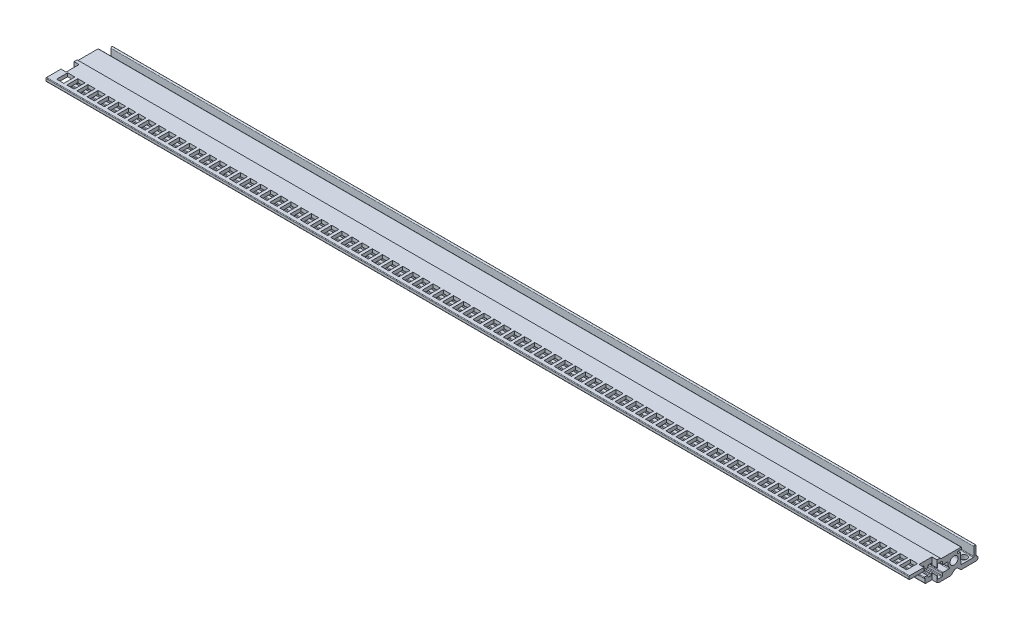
from build123d import *

# Parameters (mm, degrees)
SKETCH_1_R          = 2
EXTRUDE_1_DEPTH     = 215.9
EXTRUDE_4_DEPTH     = 431.8
EXTRUDE_3_DEPTH     = 431.8
CUT_EXTRUDE_1_REACH = 219.734
SKETCH_3_W          = 2.54
SKETCH_3_H          = 6.5
SKETCH_4_R          = 1.65
CUT_EXTRUDE_2_DEPTH = 9.8
SKETCH_5_W          = 3.6
SKETCH_5_H          = 5.5
CUT_EXTRUDE_3_DEPTH = 9.9
FILLET_1_R          = 0.3


with BuildPart() as part:
    # Sketch 1 → Extrude 1 (new, symmetric)
    with BuildSketch(Plane(origin=(0, 0, 0), x_dir=(0, 0, -1), z_dir=(1, 0, 0))):
        with BuildLine():
            Line((2.006061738, 2.145757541), (2.056061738, 2.145757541))
            ThreePointArc((2.056061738, 2.145757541), (2.197483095, 2.087178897), (2.256061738, 1.945757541))
            Line((2.256061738, 1.945757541), (2.256061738, -0.054242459))
            ThreePointArc((2.256061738, -0.054242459), (2.343929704, -0.266374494), (2.556061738, -0.354242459))
            Line((2.556061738, -0.354242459), (6.056061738, -0.354242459))
            ThreePointArc((6.056061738, -0.354242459), (6.245798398, -0.421863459), (6.350000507, -0.594242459))
            ThreePointArc((6.350000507, -0.594242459), (6.41946858, -0.709161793), (6.545959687, -0.754242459))
            Line((6.545959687, -0.754242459), (12.640079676, -0.754242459))
            ThreePointArc((12.640079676, -0.754242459), (12.748258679, -0.734059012), (12.841881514, -0.676224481))
            Line((12.841881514, -0.676224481), (14.682337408, 0.99691724))
            ThreePointArc((14.682337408, 0.99691724), (14.873755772, 1.07475547), (15.070100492, 1.010346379))
            ThreePointArc((15.070100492, 1.010346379), (15.256061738, 0.945757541), (15.442022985, 1.010346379))
            ThreePointArc((15.442022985, 1.010346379), (15.638367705, 1.07475547), (15.829786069, 0.99691724))
            Line((15.829786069, 0.99691724), (17.670241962, -0.676224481))
            ThreePointArc((17.670241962, -0.676224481), (17.763864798, -0.734059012), (17.872043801, -0.754242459))
            Line((17.872043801, -0.754242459), (25.156061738, -0.754242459))
            ThreePointArc((25.156061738, -0.754242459), (26.244537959, 0.186951), (25.470347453, 1.399903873))
            ThreePointArc((25.470347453, 1.399903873), (25.315526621, 1.508114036), (25.256061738, 1.687398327))
            Line((25.256061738, 1.687398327), (25.256061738, 6.045757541))
            ThreePointArc((25.256061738, 6.045757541), (24.756061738, 6.545757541), (24.256061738, 6.045757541))
            Line((24.256061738, 6.045757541), (24.256061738, 1.745757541))
            ThreePointArc((24.256061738, 1.745757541), (24.168193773, 1.533625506), (23.956061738, 1.445757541))
            Line((23.956061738, 1.445757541), (18.056061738, 1.445757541))
            ThreePointArc((18.056061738, 1.445757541), (17.843929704, 1.533625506), (17.756061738, 1.745757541))
            Line((17.756061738, 1.745757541), (17.756061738, 3.099347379))
            ThreePointArc((17.756061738, 3.099347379), (17.729266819, 3.199347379), (17.656061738, 3.27255246))
            ThreePointArc((17.656061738, 3.27255246), (17.582856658, 3.345757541), (17.556061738, 3.445757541))
            Line((17.556061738, 3.445757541), (17.556061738, 6.745757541))
            ThreePointArc((17.556061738, 6.745757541), (17.468193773, 6.957889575), (17.256061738, 7.045757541))
            Line((17.256061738, 7.045757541), (16.356061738, 7.045757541))
            ThreePointArc((16.356061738, 7.045757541), (16.143929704, 7.133625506), (16.056061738, 7.345757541))
            Line((16.056061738, 7.345757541), (16.056061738, 7.745757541))
            ThreePointArc((16.056061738, 7.745757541), (16.143929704, 7.957889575), (16.356061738, 8.045757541))
            Line((16.356061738, 8.045757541), (17.756061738, 8.045757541))
            ThreePointArc((17.756061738, 8.045757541), (17.968193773, 8.133625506), (18.056061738, 8.345757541))
            Line((18.056061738, 8.345757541), (18.056061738, 8.745757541))
            ThreePointArc((18.056061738, 8.745757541), (17.968193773, 8.957889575), (17.756061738, 9.045757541))
            Line((17.756061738, 9.045757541), (-7.943938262, 9.045757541))
            ThreePointArc((-7.943938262, 9.045757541), (-8.156070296, 8.957889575), (-8.243938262, 8.745757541))
            Line((-8.243938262, 8.745757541), (-8.243938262, 8.145757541))
            ThreePointArc((-8.243938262, 8.145757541), (-8.156070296, 7.933625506), (-7.943938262, 7.845757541))
            Line((-7.943938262, 7.845757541), (1.456061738, 7.845757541))
            ThreePointArc((1.456061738, 7.845757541), (1.668193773, 7.757889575), (1.756061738, 7.545757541))
            Line((1.756061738, 7.545757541), (1.756061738, 6.345757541))
            ThreePointArc((1.756061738, 6.345757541), (1.843929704, 6.133625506), (2.056061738, 6.045757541))
            Line((2.056061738, 6.045757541), (3.456061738, 6.045757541))
            ThreePointArc((3.456061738, 6.045757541), (3.668193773, 6.133625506), (3.756061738, 6.345757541))
            Line((3.756061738, 6.345757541), (3.756061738, 6.745757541))
            ThreePointArc((3.756061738, 6.745757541), (3.843929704, 6.957889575), (4.056061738, 7.045757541))
            Line((4.056061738, 7.045757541), (5.156061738, 7.045757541))
            ThreePointArc((5.156061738, 7.045757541), (5.368193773, 6.957889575), (5.456061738, 6.745757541))
            Line((5.456061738, 6.745757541), (5.456061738, 6.345757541))
            ThreePointArc((5.456061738, 6.345757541), (5.756061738, 6.045757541), (6.056061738, 6.345757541))
            Line((6.056061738, 6.345757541), (6.056061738, 7.405757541))
            ThreePointArc((6.056061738, 7.405757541), (6.143929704, 7.617889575), (6.356061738, 7.705757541))
            Line((6.356061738, 7.705757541), (8.156061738, 7.705757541))
            ThreePointArc((8.156061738, 7.705757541), (8.368193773, 7.617889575), (8.456061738, 7.405757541))
            Line((8.456061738, 7.405757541), (8.456061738, 6.345757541))
            ThreePointArc((8.456061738, 6.345757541), (8.543929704, 6.133625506), (8.756061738, 6.045757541))
            Line((8.756061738, 6.045757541), (10.980012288, 6.045757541))
            ThreePointArc((10.980012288, 6.045757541), (11.213256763, 5.934429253), (11.273389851, 5.683070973))
            ThreePointArc((11.273389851, 5.683070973), (11.28883719, 4.340010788), (11.879723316, 3.133817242))
            ThreePointArc((11.879723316, 3.133817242), (11.916556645, 2.816177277), (11.645985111, 2.645757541))
            Line((11.645985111, 2.645757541), (8.756061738, 2.645757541))
            ThreePointArc((8.756061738, 2.645757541), (8.543929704, 2.557889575), (8.456061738, 2.345757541))
            Line((8.456061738, 2.345757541), (8.456061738, 1.285757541))
            ThreePointArc((8.456061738, 1.285757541), (8.368193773, 1.073625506), (8.156061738, 0.985757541))
            Line((8.156061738, 0.985757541), (6.356061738, 0.985757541))
            ThreePointArc((6.356061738, 0.985757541), (6.143929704, 1.073625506), (6.056061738, 1.285757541))
            Line((6.056061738, 1.285757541), (6.056061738, 2.345757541))
            ThreePointArc((6.056061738, 2.345757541), (5.756061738, 2.645757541), (5.456061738, 2.345757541))
            Line((5.456061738, 2.345757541), (5.456061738, 1.945757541))
            ThreePointArc((5.456061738, 1.945757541), (5.368193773, 1.733625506), (5.156061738, 1.645757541))
            Line((5.156061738, 1.645757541), (4.056061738, 1.645757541))
            ThreePointArc((4.056061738, 1.645757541), (3.843929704, 1.733625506), (3.756061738, 1.945757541))
            Line((3.756061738, 1.945757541), (3.756061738, 2.345757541))
            ThreePointArc((3.756061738, 2.345757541), (3.668193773, 2.557889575), (3.456061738, 2.645757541))
            Line((3.456061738, 2.645757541), (2.006061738, 2.645757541))
            ThreePointArc((2.006061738, 2.645757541), (1.756061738, 2.395757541), (2.006061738, 2.145757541))
        make_face()
        with Locations((14.256061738, 5.045757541)):
            Circle(SKETCH_1_R, mode=Mode.SUBTRACT)
    extrude(amount=EXTRUDE_1_DEPTH, both=True)

    # Sketch 7 → Extrude 4 (add, through all)
    with BuildSketch(Plane(origin=(215.9, 0, 0), x_dir=(0, 0, -1), z_dir=(1, 0, 0))):
        with BuildLine():
            Line((-7.943938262, 9.045757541), (-8.243938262, 9.045757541))
            Line((-8.243938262, 9.045757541), (-8.243938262, 8.745757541))
            ThreePointArc((-8.243938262, 8.745757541), (-8.156070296, 8.957889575), (-7.943938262, 9.045757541))
        make_face()
    extrude(amount=-EXTRUDE_4_DEPTH)

    # Sketch 6 → Extrude 3 (add, through all)
    with BuildSketch(Plane.ZY.offset(215.9)):
        Polygon((-7.806061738, 9.045757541), (8.243938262, 9.045757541), (8.243938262, 9.545757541), (-7.306061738, 9.545757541), align=None)
    extrude(amount=-EXTRUDE_3_DEPTH)

    # Cut-Extrude 1: up to this face of the body (flat: up to its plane)
    cut_extrude_1_end = Plane(part.part.faces().sort_by_distance((0, -0.754242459, -9.593019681))[0])
    # Sketch 3 → Cut-Extrude 1 (cut, up to the picked face)
    with BuildSketch(Plane(origin=(0, 9.545757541, 0), x_dir=(1, 0, 0), z_dir=(0, 1, 0)), mode=Mode.PRIVATE) as cut_extrude_1_sk1:
        with Locations((214.63, 2.506061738)):
            Rectangle(SKETCH_3_W, SKETCH_3_H)
    cut_extrude_1_tool1 = split(extrude(cut_extrude_1_sk1.sketch, amount=-CUT_EXTRUDE_1_REACH, mode=Mode.PRIVATE), bisect_by=cut_extrude_1_end, keep=Keep.BOTH, mode=Mode.PRIVATE)
    # Sketch 3 → Cut-Extrude 1 (cut, up to the picked face)
    with BuildSketch(Plane(origin=(0, 9.545757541, 0), x_dir=(1, 0, 0), z_dir=(0, 1, 0)), mode=Mode.PRIVATE) as cut_extrude_1_sk2:
        with Locations((-214.63, 2.506061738)):
            Rectangle(SKETCH_3_W, SKETCH_3_H)
    cut_extrude_1_tool2 = split(extrude(cut_extrude_1_sk2.sketch, amount=-CUT_EXTRUDE_1_REACH, mode=Mode.PRIVATE), bisect_by=cut_extrude_1_end, keep=Keep.BOTH, mode=Mode.PRIVATE)
    add(cut_extrude_1_tool1.solids().sort_by(Axis((214.63, 9.545758, -2.506062), (0, -1, 0)))[0], mode=Mode.SUBTRACT)
    add(cut_extrude_1_tool2.solids().sort_by(Axis((-214.63, 9.545758, -2.506062), (0, -1, 0)))[0], mode=Mode.SUBTRACT)

    # Sketch 4 → Cut-Extrude 2 (cut)
    with BuildSketch(Plane(origin=(0, -0.754242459, 0), x_dir=(-1, 0, 0), z_dir=(0, -1, 0))):
        with Locations(Location((-213.36, 21.706061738, 0), (0, 0, 90))):
            Circle(SKETCH_4_R)
        with Locations(Location((-208.28, 21.706061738, 0), (0, 0, 90))):
            Circle(SKETCH_4_R)
        with Locations(Location((-203.2, 21.706061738, 0), (0, 0, 90))):
            Circle(SKETCH_4_R)
        with Locations(Location((-198.12, 21.706061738, 0), (0, 0, 90))):
            Circle(SKETCH_4_R)
        with Locations(Location((-193.04, 21.706061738, 0), (0, 0, 90))):
            Circle(SKETCH_4_R)
        with Locations(Location((-187.96, 21.706061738, 0), (0, 0, 90))):
            Circle(SKETCH_4_R)
        with Locations(Location((-182.88, 21.706061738, 0), (0, 0, 90))):
            Circle(SKETCH_4_R)
        with Locations(Location((-177.8, 21.706061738, 0), (0, 0, 90))):
            Circle(SKETCH_4_R)
        with Locations(Location((-172.72, 21.706061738, 0), (0, 0, 90))):
            Circle(SKETCH_4_R)
        with Locations(Location((-167.64, 21.706061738, 0), (0, 0, 90))):
            Circle(SKETCH_4_R)
        with Locations(Location((-162.56, 21.706061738, 0), (0, 0, 90))):
            Circle(SKETCH_4_R)
        with Locations(Location((-157.48, 21.706061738, 0), (0, 0, 90))):
            Circle(SKETCH_4_R)
        with Locations(Location((-152.4, 21.706061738, 0), (0, 0, 90))):
            Circle(SKETCH_4_R)
        with Locations(Location((-147.32, 21.706061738, 0), (0, 0, 90))):
            Circle(SKETCH_4_R)
        with Locations(Location((-142.24, 21.706061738, 0), (0, 0, 90))):
            Circle(SKETCH_4_R)
        with Locations(Location((-137.16, 21.706061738, 0), (0, 0, 90))):
            Circle(SKETCH_4_R)
        with Locations(Location((-132.08, 21.706061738, 0), (0, 0, 90))):
            Circle(SKETCH_4_R)
        with Locations(Location((-127, 21.706061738, 0), (0, 0, 90))):
            Circle(SKETCH_4_R)
        with Locations(Location((-121.92, 21.706061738, 0), (0, 0, 90))):
            Circle(SKETCH_4_R)
        with Locations(Location((-116.84, 21.706061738, 0), (0, 0, 90))):
            Circle(SKETCH_4_R)
        with Locations(Location((-111.76, 21.706061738, 0), (0, 0, 90))):
            Circle(SKETCH_4_R)
        with Locations(Location((-106.68, 21.706061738, 0), (0, 0, 90))):
            Circle(SKETCH_4_R)
        with Locations(Location((-101.6, 21.706061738, 0), (0, 0, 90))):
            Circle(SKETCH_4_R)
        with Locations(Location((-96.52, 21.706061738, 0), (0, 0, 90))):
            Circle(SKETCH_4_R)
        with Locations(Location((-91.44, 21.706061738, 0), (0, 0, 90))):
            Circle(SKETCH_4_R)
        with Locations(Location((-86.36, 21.706061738, 0), (0, 0, 90))):
            Circle(SKETCH_4_R)
        with Locations(Location((-81.28, 21.706061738, 0), (0, 0, 90))):
            Circle(SKETCH_4_R)
        with Locations(Location((-76.2, 21.706061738, 0), (0, 0, 90))):
            Circle(SKETCH_4_R)
        with Locations(Location((-71.12, 21.706061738, 0), (0, 0, 90))):
            Circle(SKETCH_4_R)
        with Locations(Location((-66.04, 21.706061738, 0), (0, 0, 90))):
            Circle(SKETCH_4_R)
        with Locations(Location((-60.96, 21.706061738, 0), (0, 0, 90))):
            Circle(SKETCH_4_R)
        with Locations(Location((-55.88, 21.706061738, 0), (0, 0, 90))):
            Circle(SKETCH_4_R)
        with Locations(Location((-50.8, 21.706061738, 0), (0, 0, 90))):
            Circle(SKETCH_4_R)
        with Locations(Location((-45.72, 21.706061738, 0), (0, 0, 90))):
            Circle(SKETCH_4_R)
        with Locations(Location((-40.64, 21.706061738, 0), (0, 0, 90))):
            Circle(SKETCH_4_R)
        with Locations(Location((-35.56, 21.706061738, 0), (0, 0, 90))):
            Circle(SKETCH_4_R)
        with Locations(Location((-30.48, 21.706061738, 0), (0, 0, 90))):
            Circle(SKETCH_4_R)
        with Locations(Location((-25.4, 21.706061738, 0), (0, 0, 90))):
            Circle(SKETCH_4_R)
        with Locations(Location((-20.32, 21.706061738, 0), (0, 0, 90))):
            Circle(SKETCH_4_R)
        with Locations(Location((-15.24, 21.706061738, 0), (0, 0, 90))):
            Circle(SKETCH_4_R)
        with Locations(Location((-10.16, 21.706061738, 0), (0, 0, 90))):
            Circle(SKETCH_4_R)
        with Locations(Location((-5.08, 21.706061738, 0), (0, 0, 90))):
            Circle(SKETCH_4_R)
        with Locations(Location((0, 21.706061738, 0), (0, 0, 90))):
            Circle(SKETCH_4_R)
        with Locations(Location((5.08, 21.706061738, 0), (0, 0, 90))):
            Circle(SKETCH_4_R)
        with Locations(Location((10.16, 21.706061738, 0), (0, 0, 90))):
            Circle(SKETCH_4_R)
        with Locations(Location((15.24, 21.706061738, 0), (0, 0, 90))):
            Circle(SKETCH_4_R)
        with Locations(Location((20.32, 21.706061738, 0), (0, 0, 90))):
            Circle(SKETCH_4_R)
        with Locations(Location((25.4, 21.706061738, 0), (0, 0, 90))):
            Circle(SKETCH_4_R)
        with Locations(Location((30.48, 21.706061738, 0), (0, 0, 90))):
            Circle(SKETCH_4_R)
        with Locations(Location((35.56, 21.706061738, 0), (0, 0, 90))):
            Circle(SKETCH_4_R)
        with Locations(Location((40.64, 21.706061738, 0), (0, 0, 90))):
            Circle(SKETCH_4_R)
        with Locations(Location((45.72, 21.706061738, 0), (0, 0, 90))):
            Circle(SKETCH_4_R)
        with Locations(Location((50.8, 21.706061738, 0), (0, 0, 90))):
            Circle(SKETCH_4_R)
        with Locations(Location((55.88, 21.706061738, 0), (0, 0, 90))):
            Circle(SKETCH_4_R)
        with Locations(Location((60.96, 21.706061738, 0), (0, 0, 90))):
            Circle(SKETCH_4_R)
        with Locations(Location((66.04, 21.706061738, 0), (0, 0, 90))):
            Circle(SKETCH_4_R)
        with Locations(Location((71.12, 21.706061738, 0), (0, 0, 90))):
            Circle(SKETCH_4_R)
        with Locations(Location((76.2, 21.706061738, 0), (0, 0, 90))):
            Circle(SKETCH_4_R)
        with Locations(Location((81.28, 21.706061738, 0), (0, 0, 90))):
            Circle(SKETCH_4_R)
        with Locations(Location((86.36, 21.706061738, 0), (0, 0, 90))):
            Circle(SKETCH_4_R)
        with Locations(Location((91.44, 21.706061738, 0), (0, 0, 90))):
            Circle(SKETCH_4_R)
        with Locations(Location((96.52, 21.706061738, 0), (0, 0, 90))):
            Circle(SKETCH_4_R)
        with Locations(Location((101.6, 21.706061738, 0), (0, 0, 90))):
            Circle(SKETCH_4_R)
        with Locations(Location((106.68, 21.706061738, 0), (0, 0, 90))):
            Circle(SKETCH_4_R)
        with Locations(Location((111.76, 21.706061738, 0), (0, 0, 90))):
            Circle(SKETCH_4_R)
        with Locations(Location((116.84, 21.706061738, 0), (0, 0, 90))):
            Circle(SKETCH_4_R)
        with Locations(Location((121.92, 21.706061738, 0), (0, 0, 90))):
            Circle(SKETCH_4_R)
        with Locations(Location((127, 21.706061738, 0), (0, 0, 90))):
            Circle(SKETCH_4_R)
        with Locations(Location((132.08, 21.706061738, 0), (0, 0, 90))):
            Circle(SKETCH_4_R)
        with Locations(Location((137.16, 21.706061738, 0), (0, 0, 90))):
            Circle(SKETCH_4_R)
        with Locations(Location((142.24, 21.706061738, 0), (0, 0, 90))):
            Circle(SKETCH_4_R)
        with Locations(Location((147.32, 21.706061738, 0), (0, 0, 90))):
            Circle(SKETCH_4_R)
        with Locations(Location((152.4, 21.706061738, 0), (0, 0, 90))):
            Circle(SKETCH_4_R)
        with Locations(Location((157.48, 21.706061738, 0), (0, 0, 90))):
            Circle(SKETCH_4_R)
        with Locations(Location((162.56, 21.706061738, 0), (0, 0, 90))):
            Circle(SKETCH_4_R)
        with Locations(Location((167.64, 21.706061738, 0), (0, 0, 90))):
            Circle(SKETCH_4_R)
        with Locations(Location((172.72, 21.706061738, 0), (0, 0, 90))):
            Circle(SKETCH_4_R)
        with Locations(Location((177.8, 21.706061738, 0), (0, 0, 90))):
            Circle(SKETCH_4_R)
        with Locations(Location((182.88, 21.706061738, 0), (0, 0, 90))):
            Circle(SKETCH_4_R)
        with Locations(Location((187.96, 21.706061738, 0), (0, 0, 90))):
            Circle(SKETCH_4_R)
        with Locations(Location((193.04, 21.706061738, 0), (0, 0, 90))):
            Circle(SKETCH_4_R)
        with Locations(Location((198.12, 21.706061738, 0), (0, 0, 90))):
            Circle(SKETCH_4_R)
        with Locations(Location((203.2, 21.706061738, 0), (0, 0, 90))):
            Circle(SKETCH_4_R)
        with Locations(Location((208.28, 21.706061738, 0), (0, 0, 90))):
            Circle(SKETCH_4_R)
        with Locations(Location((213.36, 21.706061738, 0), (0, 0, 90))):
            Circle(SKETCH_4_R)
    extrude(amount=-CUT_EXTRUDE_2_DEPTH, mode=Mode.SUBTRACT)

    # Sketch 5 → Cut-Extrude 3 (cut)
    with BuildSketch(Plane(origin=(0, 9.545757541, 0), x_dir=(1, 0, 0), z_dir=(0, 1, 0))):
        with Locations((-210.82, -3.443938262)):
            Rectangle(SKETCH_5_W, SKETCH_5_H)
        with Locations((-205.74, -3.443938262)):
            Rectangle(SKETCH_5_W, SKETCH_5_H)
        with Locations((-200.66, -3.443938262)):
            Rectangle(SKETCH_5_W, SKETCH_5_H)
        with Locations((-195.58, -3.443938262)):
            Rectangle(SKETCH_5_W, SKETCH_5_H)
        with Locations((-190.5, -3.443938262)):
            Rectangle(SKETCH_5_W, SKETCH_5_H)
        with Locations((-185.42, -3.443938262)):
            Rectangle(SKETCH_5_W, SKETCH_5_H)
        with Locations((-180.34, -3.443938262)):
            Rectangle(SKETCH_5_W, SKETCH_5_H)
        with Locations((-175.26, -3.443938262)):
            Rectangle(SKETCH_5_W, SKETCH_5_H)
        with Locations((-170.18, -3.443938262)):
            Rectangle(SKETCH_5_W, SKETCH_5_H)
        with Locations((-165.1, -3.443938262)):
            Rectangle(SKETCH_5_W, SKETCH_5_H)
        with Locations((-160.02, -3.443938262)):
            Rectangle(SKETCH_5_W, SKETCH_5_H)
        with Locations((-154.94, -3.443938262)):
            Rectangle(SKETCH_5_W, SKETCH_5_H)
        with Locations((-149.86, -3.443938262)):
            Rectangle(SKETCH_5_W, SKETCH_5_H)
        with Locations((-144.78, -3.443938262)):
            Rectangle(SKETCH_5_W, SKETCH_5_H)
        with Locations((-139.7, -3.443938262)):
            Rectangle(SKETCH_5_W, SKETCH_5_H)
        with Locations((-134.62, -3.443938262)):
            Rectangle(SKETCH_5_W, SKETCH_5_H)
        with Locations((-129.54, -3.443938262)):
            Rectangle(SKETCH_5_W, SKETCH_5_H)
        with Locations((-124.46, -3.443938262)):
            Rectangle(SKETCH_5_W, SKETCH_5_H)
        with Locations((-119.38, -3.443938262)):
            Rectangle(SKETCH_5_W, SKETCH_5_H)
        with Locations((-114.3, -3.443938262)):
            Rectangle(SKETCH_5_W, SKETCH_5_H)
        with Locations((-109.22, -3.443938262)):
            Rectangle(SKETCH_5_W, SKETCH_5_H)
        with Locations((-104.14, -3.443938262)):
            Rectangle(SKETCH_5_W, SKETCH_5_H)
        with Locations((-99.06, -3.443938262)):
            Rectangle(SKETCH_5_W, SKETCH_5_H)
        with Locations((-93.98, -3.443938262)):
            Rectangle(SKETCH_5_W, SKETCH_5_H)
        with Locations((-88.9, -3.443938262)):
            Rectangle(SKETCH_5_W, SKETCH_5_H)
        with Locations((-83.82, -3.443938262)):
            Rectangle(SKETCH_5_W, SKETCH_5_H)
        with Locations((-78.74, -3.443938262)):
            Rectangle(SKETCH_5_W, SKETCH_5_H)
        with Locations((-73.66, -3.443938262)):
            Rectangle(SKETCH_5_W, SKETCH_5_H)
        with Locations((-68.58, -3.443938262)):
            Rectangle(SKETCH_5_W, SKETCH_5_H)
        with Locations((-63.5, -3.443938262)):
            Rectangle(SKETCH_5_W, SKETCH_5_H)
        with Locations((-58.42, -3.443938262)):
            Rectangle(SKETCH_5_W, SKETCH_5_H)
        with Locations((-53.34, -3.443938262)):
            Rectangle(SKETCH_5_W, SKETCH_5_H)
        with Locations((-48.26, -3.443938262)):
            Rectangle(SKETCH_5_W, SKETCH_5_H)
        with Locations((-43.18, -3.443938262)):
            Rectangle(SKETCH_5_W, SKETCH_5_H)
        with Locations((-38.1, -3.443938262)):
            Rectangle(SKETCH_5_W, SKETCH_5_H)
        with Locations((-33.02, -3.443938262)):
            Rectangle(SKETCH_5_W, SKETCH_5_H)
        with Locations((-27.94, -3.443938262)):
            Rectangle(SKETCH_5_W, SKETCH_5_H)
        with Locations((-22.86, -3.443938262)):
            Rectangle(SKETCH_5_W, SKETCH_5_H)
        with Locations((-17.78, -3.443938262)):
            Rectangle(SKETCH_5_W, SKETCH_5_H)
        with Locations((-12.7, -3.443938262)):
            Rectangle(SKETCH_5_W, SKETCH_5_H)
        with Locations((-7.62, -3.443938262)):
            Rectangle(SKETCH_5_W, SKETCH_5_H)
        with Locations((-2.54, -3.443938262)):
            Rectangle(SKETCH_5_W, SKETCH_5_H)
        with Locations((2.54, -3.443938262)):
            Rectangle(SKETCH_5_W, SKETCH_5_H)
        with Locations((7.62, -3.443938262)):
            Rectangle(SKETCH_5_W, SKETCH_5_H)
        with Locations((12.7, -3.443938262)):
            Rectangle(SKETCH_5_W, SKETCH_5_H)
        with Locations((17.78, -3.443938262)):
            Rectangle(SKETCH_5_W, SKETCH_5_H)
        with Locations((22.86, -3.443938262)):
            Rectangle(SKETCH_5_W, SKETCH_5_H)
        with Locations((27.94, -3.443938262)):
            Rectangle(SKETCH_5_W, SKETCH_5_H)
        with Locations((33.02, -3.443938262)):
            Rectangle(SKETCH_5_W, SKETCH_5_H)
        with Locations((38.1, -3.443938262)):
            Rectangle(SKETCH_5_W, SKETCH_5_H)
        with Locations((43.18, -3.443938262)):
            Rectangle(SKETCH_5_W, SKETCH_5_H)
        with Locations((48.26, -3.443938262)):
            Rectangle(SKETCH_5_W, SKETCH_5_H)
        with Locations((53.34, -3.443938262)):
            Rectangle(SKETCH_5_W, SKETCH_5_H)
        with Locations((58.42, -3.443938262)):
            Rectangle(SKETCH_5_W, SKETCH_5_H)
        with Locations((63.5, -3.443938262)):
            Rectangle(SKETCH_5_W, SKETCH_5_H)
        with Locations((68.58, -3.443938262)):
            Rectangle(SKETCH_5_W, SKETCH_5_H)
        with Locations((73.66, -3.443938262)):
            Rectangle(SKETCH_5_W, SKETCH_5_H)
        with Locations((78.74, -3.443938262)):
            Rectangle(SKETCH_5_W, SKETCH_5_H)
        with Locations((83.82, -3.443938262)):
            Rectangle(SKETCH_5_W, SKETCH_5_H)
        with Locations((88.9, -3.443938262)):
            Rectangle(SKETCH_5_W, SKETCH_5_H)
        with Locations((93.98, -3.443938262)):
            Rectangle(SKETCH_5_W, SKETCH_5_H)
        with Locations((99.06, -3.443938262)):
            Rectangle(SKETCH_5_W, SKETCH_5_H)
        with Locations((104.14, -3.443938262)):
            Rectangle(SKETCH_5_W, SKETCH_5_H)
        with Locations((109.22, -3.443938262)):
            Rectangle(SKETCH_5_W, SKETCH_5_H)
        with Locations((114.3, -3.443938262)):
            Rectangle(SKETCH_5_W, SKETCH_5_H)
        with Locations((119.38, -3.443938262)):
            Rectangle(SKETCH_5_W, SKETCH_5_H)
        with Locations((124.46, -3.443938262)):
            Rectangle(SKETCH_5_W, SKETCH_5_H)
        with Locations((129.54, -3.443938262)):
            Rectangle(SKETCH_5_W, SKETCH_5_H)
        with Locations((134.62, -3.443938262)):
            Rectangle(SKETCH_5_W, SKETCH_5_H)
        with Locations((139.7, -3.443938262)):
            Rectangle(SKETCH_5_W, SKETCH_5_H)
        with Locations((144.78, -3.443938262)):
            Rectangle(SKETCH_5_W, SKETCH_5_H)
        with Locations((149.86, -3.443938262)):
            Rectangle(SKETCH_5_W, SKETCH_5_H)
        with Locations((154.94, -3.443938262)):
            Rectangle(SKETCH_5_W, SKETCH_5_H)
        with Locations((160.02, -3.443938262)):
            Rectangle(SKETCH_5_W, SKETCH_5_H)
        with Locations((165.1, -3.443938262)):
            Rectangle(SKETCH_5_W, SKETCH_5_H)
        with Locations((170.18, -3.443938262)):
            Rectangle(SKETCH_5_W, SKETCH_5_H)
        with Locations((175.26, -3.443938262)):
            Rectangle(SKETCH_5_W, SKETCH_5_H)
        with Locations((180.34, -3.443938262)):
            Rectangle(SKETCH_5_W, SKETCH_5_H)
        with Locations((185.42, -3.443938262)):
            Rectangle(SKETCH_5_W, SKETCH_5_H)
        with Locations((190.5, -3.443938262)):
            Rectangle(SKETCH_5_W, SKETCH_5_H)
        with Locations((195.58, -3.443938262)):
            Rectangle(SKETCH_5_W, SKETCH_5_H)
        with Locations((200.66, -3.443938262)):
            Rectangle(SKETCH_5_W, SKETCH_5_H)
        with Locations((205.74, -3.443938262)):
            Rectangle(SKETCH_5_W, SKETCH_5_H)
        with Locations((210.82, -3.443938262)):
            Rectangle(SKETCH_5_W, SKETCH_5_H)
    extrude(amount=-CUT_EXTRUDE_3_DEPTH, mode=Mode.SUBTRACT)

    # Fillet 1
    fillet_1_edges = [part.edges().sort_by_distance(p)[0] for p in [
        (0, 9.545757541, 8.243938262),
    ]]
    fillet(fillet_1_edges, radius=FILLET_1_R)


solid = part.part
